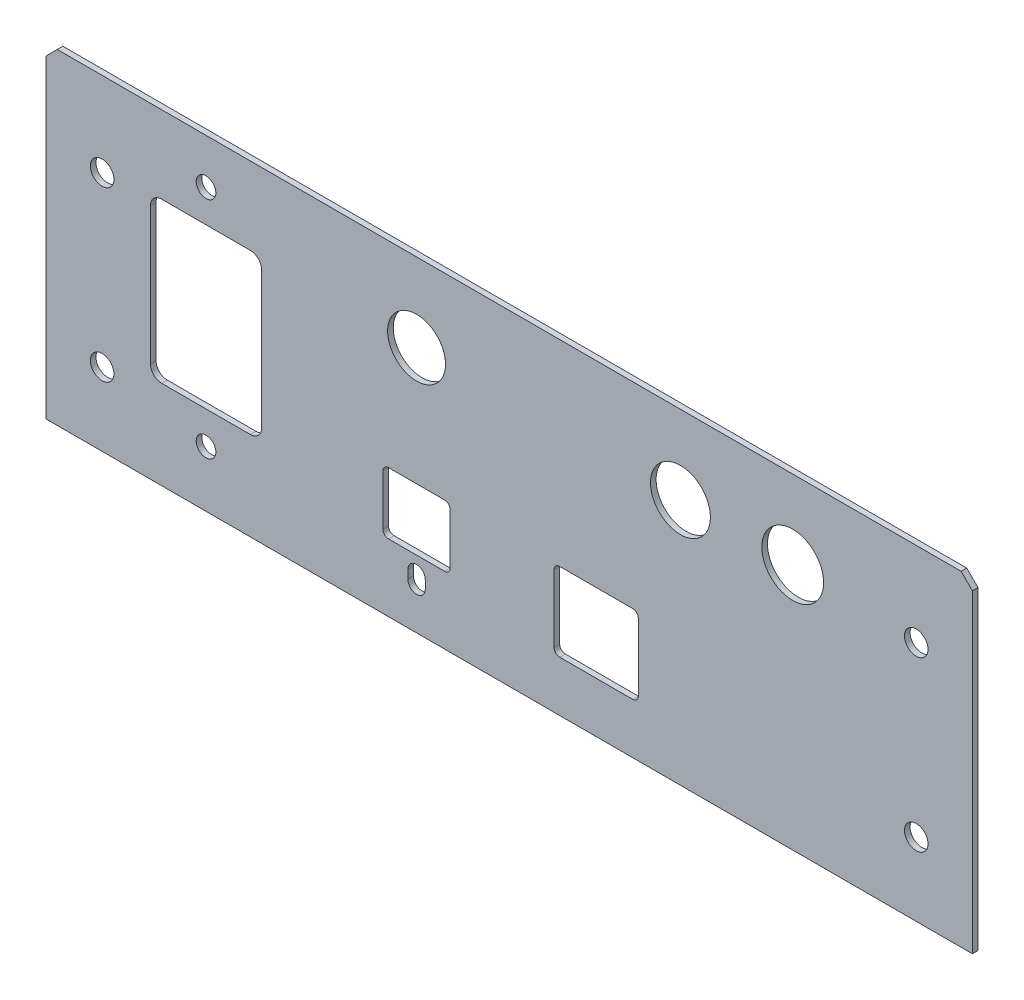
ISO-10303-21;
HEADER;
FILE_DESCRIPTION(('STEP AP214'),'2;1');
FILE_NAME('part.step','',(''),(''),'','','');
FILE_SCHEMA(('AUTOMOTIVE_DESIGN { 1 0 10303 214 1 1 1 1 }'));
ENDSEC;
DATA;
#1=APPLICATION_CONTEXT('core data for automotive mechanical design processes');
#2=APPLICATION_PROTOCOL_DEFINITION('international standard','automotive_design',2000,#1);
#3=PRODUCT_CONTEXT('',#1,'mechanical');
#4=PRODUCT('Part','Part','',(#3));
#5=PRODUCT_RELATED_PRODUCT_CATEGORY('part','',(#4));
#6=PRODUCT_DEFINITION_FORMATION('','',#4);
#7=PRODUCT_DEFINITION_CONTEXT('part definition',#1,'design');
#8=PRODUCT_DEFINITION('design','',#6,#7);
#9=PRODUCT_DEFINITION_SHAPE('','',#8);
#10=(LENGTH_UNIT() NAMED_UNIT(*) SI_UNIT(.MILLI.,.METRE.));
#11=(NAMED_UNIT(*) PLANE_ANGLE_UNIT() SI_UNIT($,.RADIAN.));
#12=(NAMED_UNIT(*) SI_UNIT($,.STERADIAN.) SOLID_ANGLE_UNIT());
#13=UNCERTAINTY_MEASURE_WITH_UNIT(LENGTH_MEASURE(1.E-05),#10,'distance_accuracy_value','');
#14=(GEOMETRIC_REPRESENTATION_CONTEXT(3) GLOBAL_UNCERTAINTY_ASSIGNED_CONTEXT((#13)) GLOBAL_UNIT_ASSIGNED_CONTEXT((#10,
#11,#12)) REPRESENTATION_CONTEXT('',''));
#15=CARTESIAN_POINT('',(0.,0.,0.));
#16=DIRECTION('',(0.,0.,1.));
#17=DIRECTION('',(1.,0.,0.));
#18=AXIS2_PLACEMENT_3D('',#15,#16,#17);
#19=CARTESIAN_POINT('',(82.5,27.,-1.));
#20=DIRECTION('',(1.,0.,0.));
#21=DIRECTION('',(0.,1.,0.));
#22=AXIS2_PLACEMENT_3D('',#19,#20,#21);
#23=PLANE('',#22);
#24=DIRECTION('',(0.,1.,0.));
#25=VECTOR('',#24,1.);
#26=CARTESIAN_POINT('',(82.5,27.,0.));
#27=LINE('',#26,#25);
#28=CARTESIAN_POINT('',(82.5,-29.,0.));
#29=VERTEX_POINT('',#28);
#30=CARTESIAN_POINT('',(82.5,27.,0.));
#31=VERTEX_POINT('',#30);
#32=EDGE_CURVE('E532',#29,#31,#27,.T.);
#33=ORIENTED_EDGE('',*,*,#32,.F.);
#34=DIRECTION('',(0.,0.,1.));
#35=VECTOR('',#34,1.);
#36=CARTESIAN_POINT('',(82.5,-29.,-1.));
#37=LINE('',#36,#35);
#38=CARTESIAN_POINT('',(82.5,-29.,-1.));
#39=VERTEX_POINT('',#38);
#40=EDGE_CURVE('E11',#39,#29,#37,.T.);
#41=ORIENTED_EDGE('',*,*,#40,.F.);
#42=DIRECTION('',(0.,1.,0.));
#43=VECTOR('',#42,1.);
#44=CARTESIAN_POINT('',(82.5,27.,-1.));
#45=LINE('',#44,#43);
#46=CARTESIAN_POINT('',(82.5,27.,-1.));
#47=VERTEX_POINT('',#46);
#48=EDGE_CURVE('E533',#39,#47,#45,.T.);
#49=ORIENTED_EDGE('',*,*,#48,.T.);
#50=DIRECTION('',(0.,0.,1.));
#51=VECTOR('',#50,1.);
#52=CARTESIAN_POINT('',(82.5,27.,-1.));
#53=LINE('',#52,#51);
#54=EDGE_CURVE('E42',#47,#31,#53,.T.);
#55=ORIENTED_EDGE('',*,*,#54,.T.);
#56=EDGE_LOOP('',(#33,#41,#49,#55));
#57=FACE_BOUND('',#56,.T.);
#58=ADVANCED_FACE('F39',(#57),#23,.T.);
#59=CARTESIAN_POINT('',(-82.5,-29.,-1.));
#60=DIRECTION('',(0.,-1.,0.));
#61=DIRECTION('',(0.,0.,-1.));
#62=AXIS2_PLACEMENT_3D('',#59,#60,#61);
#63=PLANE('',#62);
#64=DIRECTION('',(1.,0.,0.));
#65=VECTOR('',#64,1.);
#66=CARTESIAN_POINT('',(-82.5,-29.,0.));
#67=LINE('',#66,#65);
#68=CARTESIAN_POINT('',(-82.5,-29.,0.));
#69=VERTEX_POINT('',#68);
#70=EDGE_CURVE('E537',#69,#29,#67,.T.);
#71=ORIENTED_EDGE('',*,*,#70,.F.);
#72=DIRECTION('',(0.,0.,1.));
#73=VECTOR('',#72,1.);
#74=CARTESIAN_POINT('',(-82.5,-29.,-1.));
#75=LINE('',#74,#73);
#76=CARTESIAN_POINT('',(-82.5,-29.,-1.));
#77=VERTEX_POINT('',#76);
#78=EDGE_CURVE('E47',#77,#69,#75,.T.);
#79=ORIENTED_EDGE('',*,*,#78,.F.);
#80=DIRECTION('',(1.,0.,0.));
#81=VECTOR('',#80,1.);
#82=CARTESIAN_POINT('',(-82.5,-29.,-1.));
#83=LINE('',#82,#81);
#84=EDGE_CURVE('E549',#77,#39,#83,.T.);
#85=ORIENTED_EDGE('',*,*,#84,.T.);
#86=ORIENTED_EDGE('',*,*,#40,.T.);
#87=EDGE_LOOP('',(#71,#79,#85,#86));
#88=FACE_BOUND('',#87,.T.);
#89=ADVANCED_FACE('F586',(#88),#63,.T.);
#90=CARTESIAN_POINT('',(-82.5,27.,-1.));
#91=DIRECTION('',(-1.,0.,0.));
#92=DIRECTION('',(0.,0.,1.));
#93=AXIS2_PLACEMENT_3D('',#90,#91,#92);
#94=PLANE('',#93);
#95=DIRECTION('',(0.,-1.,0.));
#96=VECTOR('',#95,1.);
#97=CARTESIAN_POINT('',(-82.5,27.,0.));
#98=LINE('',#97,#96);
#99=CARTESIAN_POINT('',(-82.5,27.,0.));
#100=VERTEX_POINT('',#99);
#101=EDGE_CURVE('E563',#100,#69,#98,.T.);
#102=ORIENTED_EDGE('',*,*,#101,.F.);
#103=DIRECTION('',(0.,0.,1.));
#104=VECTOR('',#103,1.);
#105=CARTESIAN_POINT('',(-82.5,27.,-1.));
#106=LINE('',#105,#104);
#107=CARTESIAN_POINT('',(-82.5,27.,-1.));
#108=VERTEX_POINT('',#107);
#109=EDGE_CURVE('E569',#108,#100,#106,.T.);
#110=ORIENTED_EDGE('',*,*,#109,.F.);
#111=DIRECTION('',(0.,-1.,0.));
#112=VECTOR('',#111,1.);
#113=CARTESIAN_POINT('',(-82.5,27.,-1.));
#114=LINE('',#113,#112);
#115=EDGE_CURVE('E546',#108,#77,#114,.T.);
#116=ORIENTED_EDGE('',*,*,#115,.T.);
#117=ORIENTED_EDGE('',*,*,#78,.T.);
#118=EDGE_LOOP('',(#102,#110,#116,#117));
#119=FACE_BOUND('',#118,.T.);
#120=ADVANCED_FACE('F598',(#119),#94,.T.);
#121=CARTESIAN_POINT('',(-80.5,29.,-1.));
#122=DIRECTION('',(-0.707106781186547,0.707106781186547,0.));
#123=DIRECTION('',(-0.707106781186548,-0.707106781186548,0.));
#124=AXIS2_PLACEMENT_3D('',#121,#122,#123);
#125=PLANE('',#124);
#126=DIRECTION('',(-0.707106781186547,-0.707106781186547,0.));
#127=VECTOR('',#126,1.);
#128=CARTESIAN_POINT('',(-80.5,29.,0.));
#129=LINE('',#128,#127);
#130=CARTESIAN_POINT('',(-80.5,29.,0.));
#131=VERTEX_POINT('',#130);
#132=EDGE_CURVE('E560',#131,#100,#129,.T.);
#133=ORIENTED_EDGE('',*,*,#132,.F.);
#134=DIRECTION('',(0.,0.,1.));
#135=VECTOR('',#134,1.);
#136=CARTESIAN_POINT('',(-80.5,29.,-1.));
#137=LINE('',#136,#135);
#138=CARTESIAN_POINT('',(-80.5,29.,-1.));
#139=VERTEX_POINT('',#138);
#140=EDGE_CURVE('E571',#139,#131,#137,.T.);
#141=ORIENTED_EDGE('',*,*,#140,.F.);
#142=DIRECTION('',(-0.707106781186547,-0.707106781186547,0.));
#143=VECTOR('',#142,1.);
#144=CARTESIAN_POINT('',(-80.5,29.,-1.));
#145=LINE('',#144,#143);
#146=EDGE_CURVE('E543',#139,#108,#145,.T.);
#147=ORIENTED_EDGE('',*,*,#146,.T.);
#148=ORIENTED_EDGE('',*,*,#109,.T.);
#149=EDGE_LOOP('',(#133,#141,#147,#148));
#150=FACE_BOUND('',#149,.T.);
#151=ADVANCED_FACE('F596',(#150),#125,.T.);
#152=CARTESIAN_POINT('',(-80.5,29.,-1.));
#153=DIRECTION('',(0.,1.,0.));
#154=DIRECTION('',(0.,0.,1.));
#155=AXIS2_PLACEMENT_3D('',#152,#153,#154);
#156=PLANE('',#155);
#157=DIRECTION('',(-1.,0.,0.));
#158=VECTOR('',#157,1.);
#159=CARTESIAN_POINT('',(-80.5,29.,0.));
#160=LINE('',#159,#158);
#161=CARTESIAN_POINT('',(80.5,29.,0.));
#162=VERTEX_POINT('',#161);
#163=EDGE_CURVE('E557',#162,#131,#160,.T.);
#164=ORIENTED_EDGE('',*,*,#163,.F.);
#165=DIRECTION('',(0.,0.,1.));
#166=VECTOR('',#165,1.);
#167=CARTESIAN_POINT('',(80.5,29.,-1.));
#168=LINE('',#167,#166);
#169=CARTESIAN_POINT('',(80.5,29.,-1.));
#170=VERTEX_POINT('',#169);
#171=EDGE_CURVE('E572',#170,#162,#168,.T.);
#172=ORIENTED_EDGE('',*,*,#171,.F.);
#173=DIRECTION('',(-1.,0.,0.));
#174=VECTOR('',#173,1.);
#175=CARTESIAN_POINT('',(-80.5,29.,-1.));
#176=LINE('',#175,#174);
#177=EDGE_CURVE('E540',#170,#139,#176,.T.);
#178=ORIENTED_EDGE('',*,*,#177,.T.);
#179=ORIENTED_EDGE('',*,*,#140,.T.);
#180=EDGE_LOOP('',(#164,#172,#178,#179));
#181=FACE_BOUND('',#180,.T.);
#182=ADVANCED_FACE('F593',(#181),#156,.T.);
#183=CARTESIAN_POINT('',(80.5,29.,-1.));
#184=DIRECTION('',(0.707106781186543,0.707106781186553,0.));
#185=DIRECTION('',(-0.707106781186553,0.707106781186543,0.));
#186=AXIS2_PLACEMENT_3D('',#183,#184,#185);
#187=PLANE('',#186);
#188=DIRECTION('',(-0.707106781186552,0.707106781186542,0.));
#189=VECTOR('',#188,1.);
#190=CARTESIAN_POINT('',(80.5,29.,0.));
#191=LINE('',#190,#189);
#192=EDGE_CURVE('E554',#31,#162,#191,.T.);
#193=ORIENTED_EDGE('',*,*,#192,.F.);
#194=ORIENTED_EDGE('',*,*,#54,.F.);
#195=DIRECTION('',(-0.707106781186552,0.707106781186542,0.));
#196=VECTOR('',#195,1.);
#197=CARTESIAN_POINT('',(80.5,29.,-1.));
#198=LINE('',#197,#196);
#199=EDGE_CURVE('E536',#47,#170,#198,.T.);
#200=ORIENTED_EDGE('',*,*,#199,.T.);
#201=ORIENTED_EDGE('',*,*,#171,.T.);
#202=EDGE_LOOP('',(#193,#194,#200,#201));
#203=FACE_BOUND('',#202,.T.);
#204=ADVANCED_FACE('F580',(#203),#187,.T.);
#205=CARTESIAN_POINT('',(0.,0.,-1.));
#206=DIRECTION('',(0.,0.,1.));
#207=DIRECTION('',(1.,0.,0.));
#208=AXIS2_PLACEMENT_3D('',#205,#206,#207);
#209=PLANE('',#208);
#210=CARTESIAN_POINT('',(72.5,14.,-1.));
#211=DIRECTION('',(0.,0.,1.));
#212=DIRECTION('',(1.,0.,0.));
#213=AXIS2_PLACEMENT_3D('',#210,#211,#212);
#214=CIRCLE('',#213,2.1);
#215=CARTESIAN_POINT('',(74.6,14.,-1.));
#216=VERTEX_POINT('',#215);
#217=EDGE_CURVE('E325',#216,#216,#214,.F.);
#218=ORIENTED_EDGE('',*,*,#217,.F.);
#219=EDGE_LOOP('',(#218));
#220=FACE_BOUND('',#219,.T.);
#221=DIRECTION('',(0.,1.,0.));
#222=VECTOR('',#221,1.);
#223=CARTESIAN_POINT('',(8.00000000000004,-6.99999999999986,-1.));
#224=LINE('',#223,#222);
#225=CARTESIAN_POINT('',(8.00000000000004,-18.9999999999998,-1.));
#226=VERTEX_POINT('',#225);
#227=CARTESIAN_POINT('',(8.00000000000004,-6.99999999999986,-1.));
#228=VERTEX_POINT('',#227);
#229=EDGE_CURVE('E337',#226,#228,#224,.T.);
#230=ORIENTED_EDGE('',*,*,#229,.F.);
#231=CARTESIAN_POINT('',(9.00000000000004,-18.9999999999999,-1.));
#232=DIRECTION('',(0.,0.,1.));
#233=DIRECTION('',(1.,0.,0.));
#234=AXIS2_PLACEMENT_3D('',#231,#232,#233);
#235=CIRCLE('',#234,1.);
#236=CARTESIAN_POINT('',(9.00000000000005,-19.9999999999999,-1.));
#237=VERTEX_POINT('',#236);
#238=EDGE_CURVE('E340',#237,#226,#235,.F.);
#239=ORIENTED_EDGE('',*,*,#238,.F.);
#240=DIRECTION('',(-1.,0.,0.));
#241=VECTOR('',#240,1.);
#242=CARTESIAN_POINT('',(9.00000000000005,-19.9999999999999,-1.));
#243=LINE('',#242,#241);
#244=CARTESIAN_POINT('',(22.,-19.9999999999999,-1.));
#245=VERTEX_POINT('',#244);
#246=EDGE_CURVE('E369',#245,#237,#243,.T.);
#247=ORIENTED_EDGE('',*,*,#246,.F.);
#248=CARTESIAN_POINT('',(22.,-18.9999999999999,-1.));
#249=DIRECTION('',(0.,0.,1.));
#250=DIRECTION('',(1.,0.,0.));
#251=AXIS2_PLACEMENT_3D('',#248,#249,#250);
#252=CIRCLE('',#251,1.);
#253=CARTESIAN_POINT('',(23.,-18.9999999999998,-1.));
#254=VERTEX_POINT('',#253);
#255=EDGE_CURVE('E55',#254,#245,#252,.F.);
#256=ORIENTED_EDGE('',*,*,#255,.F.);
#257=DIRECTION('',(0.,-1.,0.));
#258=VECTOR('',#257,1.);
#259=CARTESIAN_POINT('',(23.,-6.99999999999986,-1.));
#260=LINE('',#259,#258);
#261=CARTESIAN_POINT('',(23.,-6.99999999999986,-1.));
#262=VERTEX_POINT('',#261);
#263=EDGE_CURVE('E324',#262,#254,#260,.T.);
#264=ORIENTED_EDGE('',*,*,#263,.F.);
#265=CARTESIAN_POINT('',(22.,-6.99999999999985,-1.));
#266=DIRECTION('',(0.,0.,1.));
#267=DIRECTION('',(1.,0.,0.));
#268=AXIS2_PLACEMENT_3D('',#265,#266,#267);
#269=CIRCLE('',#268,1.);
#270=CARTESIAN_POINT('',(22.,-5.99999999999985,-1.));
#271=VERTEX_POINT('',#270);
#272=EDGE_CURVE('E328',#271,#262,#269,.F.);
#273=ORIENTED_EDGE('',*,*,#272,.F.);
#274=DIRECTION('',(1.,0.,0.));
#275=VECTOR('',#274,1.);
#276=CARTESIAN_POINT('',(9.00000000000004,-5.99999999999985,-1.));
#277=LINE('',#276,#275);
#278=CARTESIAN_POINT('',(9.00000000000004,-5.99999999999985,-1.));
#279=VERTEX_POINT('',#278);
#280=EDGE_CURVE('E331',#279,#271,#277,.T.);
#281=ORIENTED_EDGE('',*,*,#280,.F.);
#282=CARTESIAN_POINT('',(9.00000000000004,-6.99999999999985,-1.));
#283=DIRECTION('',(0.,0.,1.));
#284=DIRECTION('',(1.,0.,0.));
#285=AXIS2_PLACEMENT_3D('',#282,#283,#284);
#286=CIRCLE('',#285,1.);
#287=EDGE_CURVE('E334',#228,#279,#286,.F.);
#288=ORIENTED_EDGE('',*,*,#287,.F.);
#289=EDGE_LOOP('',(#230,#239,#247,#256,#264,#273,#281,#288));
#290=FACE_BOUND('',#289,.T.);
#291=DIRECTION('',(1.,0.,0.));
#292=VECTOR('',#291,1.);
#293=CARTESIAN_POINT('',(-21.5,-6.00000000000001,-1.));
#294=LINE('',#293,#292);
#295=CARTESIAN_POINT('',(-21.5,-6.00000000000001,-1.));
#296=VERTEX_POINT('',#295);
#297=CARTESIAN_POINT('',(-11.5,-6.00000000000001,-1.));
#298=VERTEX_POINT('',#297);
#299=EDGE_CURVE('E285',#296,#298,#294,.T.);
#300=ORIENTED_EDGE('',*,*,#299,.F.);
#301=CARTESIAN_POINT('',(-21.5,-7.00000000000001,-1.));
#302=DIRECTION('',(0.,0.,1.));
#303=DIRECTION('',(1.,0.,0.));
#304=AXIS2_PLACEMENT_3D('',#301,#302,#303);
#305=CIRCLE('',#304,1.);
#306=CARTESIAN_POINT('',(-22.5,-7.00000000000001,-1.));
#307=VERTEX_POINT('',#306);
#308=EDGE_CURVE('E264',#307,#296,#305,.F.);
#309=ORIENTED_EDGE('',*,*,#308,.F.);
#310=DIRECTION('',(0.,1.,0.));
#311=VECTOR('',#310,1.);
#312=CARTESIAN_POINT('',(-22.5,-7.00000000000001,-1.));
#313=LINE('',#312,#311);
#314=CARTESIAN_POINT('',(-22.5,-16.,-1.));
#315=VERTEX_POINT('',#314);
#316=EDGE_CURVE('E275',#315,#307,#313,.T.);
#317=ORIENTED_EDGE('',*,*,#316,.F.);
#318=CARTESIAN_POINT('',(-21.5,-16.,-1.));
#319=DIRECTION('',(0.,0.,1.));
#320=DIRECTION('',(1.,0.,0.));
#321=AXIS2_PLACEMENT_3D('',#318,#319,#320);
#322=CIRCLE('',#321,1.);
#323=CARTESIAN_POINT('',(-21.5,-17.,-1.));
#324=VERTEX_POINT('',#323);
#325=EDGE_CURVE('E63',#324,#315,#322,.F.);
#326=ORIENTED_EDGE('',*,*,#325,.F.);
#327=DIRECTION('',(-1.,0.,0.));
#328=VECTOR('',#327,1.);
#329=CARTESIAN_POINT('',(-21.5,-17.,-1.));
#330=LINE('',#329,#328);
#331=CARTESIAN_POINT('',(-11.5,-17.,-1.));
#332=VERTEX_POINT('',#331);
#333=EDGE_CURVE('E1214',#332,#324,#330,.T.);
#334=ORIENTED_EDGE('',*,*,#333,.F.);
#335=CARTESIAN_POINT('',(-11.5,-16.,-1.));
#336=DIRECTION('',(0.,0.,1.));
#337=DIRECTION('',(1.,0.,0.));
#338=AXIS2_PLACEMENT_3D('',#335,#336,#337);
#339=CIRCLE('',#338,1.);
#340=CARTESIAN_POINT('',(-10.5,-16.,-1.));
#341=VERTEX_POINT('',#340);
#342=EDGE_CURVE('E1217',#341,#332,#339,.F.);
#343=ORIENTED_EDGE('',*,*,#342,.F.);
#344=DIRECTION('',(0.,-1.,0.));
#345=VECTOR('',#344,1.);
#346=CARTESIAN_POINT('',(-10.5,-7.00000000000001,-1.));
#347=LINE('',#346,#345);
#348=CARTESIAN_POINT('',(-10.5,-7.00000000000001,-1.));
#349=VERTEX_POINT('',#348);
#350=EDGE_CURVE('E1222',#349,#341,#347,.T.);
#351=ORIENTED_EDGE('',*,*,#350,.F.);
#352=CARTESIAN_POINT('',(-11.5,-7.00000000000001,-1.));
#353=DIRECTION('',(0.,0.,1.));
#354=DIRECTION('',(1.,0.,0.));
#355=AXIS2_PLACEMENT_3D('',#352,#353,#354);
#356=CIRCLE('',#355,1.);
#357=EDGE_CURVE('E289',#298,#349,#356,.F.);
#358=ORIENTED_EDGE('',*,*,#357,.F.);
#359=EDGE_LOOP('',(#300,#309,#317,#326,#334,#343,#351,#358));
#360=FACE_BOUND('',#359,.T.);
#361=CARTESIAN_POINT('',(-72.5,-16.,-1.));
#362=DIRECTION('',(0.,0.,1.));
#363=DIRECTION('',(1.,0.,0.));
#364=AXIS2_PLACEMENT_3D('',#361,#362,#363);
#365=CIRCLE('',#364,2.1);
#366=CARTESIAN_POINT('',(-70.4,-16.,-1.));
#367=VERTEX_POINT('',#366);
#368=EDGE_CURVE('E402',#367,#367,#365,.F.);
#369=ORIENTED_EDGE('',*,*,#368,.F.);
#370=EDGE_LOOP('',(#369));
#371=FACE_BOUND('',#370,.T.);
#372=CARTESIAN_POINT('',(72.5,-16.,-1.));
#373=DIRECTION('',(0.,0.,1.));
#374=DIRECTION('',(1.,0.,0.));
#375=AXIS2_PLACEMENT_3D('',#372,#373,#374);
#376=CIRCLE('',#375,2.1);
#377=CARTESIAN_POINT('',(74.6,-16.,-1.));
#378=VERTEX_POINT('',#377);
#379=EDGE_CURVE('E395',#378,#378,#376,.F.);
#380=ORIENTED_EDGE('',*,*,#379,.F.);
#381=EDGE_LOOP('',(#380));
#382=FACE_BOUND('',#381,.T.);
#383=CARTESIAN_POINT('',(-72.5,14.,-1.));
#384=DIRECTION('',(0.,0.,1.));
#385=DIRECTION('',(1.,0.,0.));
#386=AXIS2_PLACEMENT_3D('',#383,#384,#385);
#387=CIRCLE('',#386,2.1);
#388=CARTESIAN_POINT('',(-70.4,14.,-1.));
#389=VERTEX_POINT('',#388);
#390=EDGE_CURVE('E394',#389,#389,#387,.F.);
#391=ORIENTED_EDGE('',*,*,#390,.F.);
#392=EDGE_LOOP('',(#391));
#393=FACE_BOUND('',#392,.T.);
#394=DIRECTION('',(0.,1.,0.));
#395=VECTOR('',#394,1.);
#396=CARTESIAN_POINT('',(-18.05,-21.5,-1.));
#397=LINE('',#396,#395);
#398=CARTESIAN_POINT('',(-18.05,-21.5,-1.));
#399=VERTEX_POINT('',#398);
#400=CARTESIAN_POINT('',(-18.05,-20.,-1.));
#401=VERTEX_POINT('',#400);
#402=EDGE_CURVE('E410',#399,#401,#397,.T.);
#403=ORIENTED_EDGE('',*,*,#402,.F.);
#404=CARTESIAN_POINT('',(-16.5,-21.5,-1.));
#405=DIRECTION('',(0.,0.,1.));
#406=DIRECTION('',(1.,0.,0.));
#407=AXIS2_PLACEMENT_3D('',#404,#405,#406);
#408=CIRCLE('',#407,1.55);
#409=CARTESIAN_POINT('',(-14.95,-21.5,-1.));
#410=VERTEX_POINT('',#409);
#411=EDGE_CURVE('E413',#410,#399,#408,.F.);
#412=ORIENTED_EDGE('',*,*,#411,.F.);
#413=DIRECTION('',(0.,-1.,0.));
#414=VECTOR('',#413,1.);
#415=CARTESIAN_POINT('',(-14.95,-21.5,-1.));
#416=LINE('',#415,#414);
#417=CARTESIAN_POINT('',(-14.95,-20.,-1.));
#418=VERTEX_POINT('',#417);
#419=EDGE_CURVE('E430',#418,#410,#416,.T.);
#420=ORIENTED_EDGE('',*,*,#419,.F.);
#421=CARTESIAN_POINT('',(-16.5,-20.,-1.));
#422=DIRECTION('',(0.,0.,1.));
#423=DIRECTION('',(1.,0.,0.));
#424=AXIS2_PLACEMENT_3D('',#421,#422,#423);
#425=CIRCLE('',#424,1.55);
#426=EDGE_CURVE('E398',#401,#418,#425,.F.);
#427=ORIENTED_EDGE('',*,*,#426,.F.);
#428=EDGE_LOOP('',(#403,#412,#420,#427));
#429=FACE_BOUND('',#428,.T.);
#430=CARTESIAN_POINT('',(30.5,15.,-1.));
#431=DIRECTION('',(0.,0.,1.));
#432=DIRECTION('',(1.,0.,0.));
#433=AXIS2_PLACEMENT_3D('',#430,#431,#432);
#434=CIRCLE('',#433,5.33502606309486);
#435=CARTESIAN_POINT('',(35.8350260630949,15.,-1.));
#436=VERTEX_POINT('',#435);
#437=EDGE_CURVE('E443',#436,#436,#434,.F.);
#438=ORIENTED_EDGE('',*,*,#437,.F.);
#439=EDGE_LOOP('',(#438));
#440=FACE_BOUND('',#439,.T.);
#441=CARTESIAN_POINT('',(-16.5,15.,-1.));
#442=DIRECTION('',(0.,0.,1.));
#443=DIRECTION('',(1.,0.,0.));
#444=AXIS2_PLACEMENT_3D('',#441,#442,#443);
#445=CIRCLE('',#444,5.15465225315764);
#446=CARTESIAN_POINT('',(-11.3453477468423,15.,-1.));
#447=VERTEX_POINT('',#446);
#448=EDGE_CURVE('E444',#447,#447,#445,.F.);
#449=ORIENTED_EDGE('',*,*,#448,.F.);
#450=EDGE_LOOP('',(#449));
#451=FACE_BOUND('',#450,.T.);
#452=CARTESIAN_POINT('',(50.5,15.,-1.));
#453=DIRECTION('',(0.,0.,1.));
#454=DIRECTION('',(1.,0.,0.));
#455=AXIS2_PLACEMENT_3D('',#452,#453,#454);
#456=CIRCLE('',#455,5.5);
#457=CARTESIAN_POINT('',(56.,15.,-1.));
#458=VERTEX_POINT('',#457);
#459=EDGE_CURVE('E454',#458,#458,#456,.F.);
#460=ORIENTED_EDGE('',*,*,#459,.F.);
#461=EDGE_LOOP('',(#460));
#462=FACE_BOUND('',#461,.T.);
#463=CARTESIAN_POINT('',(-54.,21.,-1.));
#464=DIRECTION('',(0.,0.,1.));
#465=DIRECTION('',(1.,0.,0.));
#466=AXIS2_PLACEMENT_3D('',#463,#464,#465);
#467=CIRCLE('',#466,1.75);
#468=CARTESIAN_POINT('',(-52.25,21.,-1.));
#469=VERTEX_POINT('',#468);
#470=EDGE_CURVE('E461',#469,#469,#467,.F.);
#471=ORIENTED_EDGE('',*,*,#470,.F.);
#472=EDGE_LOOP('',(#471));
#473=FACE_BOUND('',#472,.T.);
#474=CARTESIAN_POINT('',(-53.9999999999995,-19.,-1.));
#475=DIRECTION('',(0.,0.,1.));
#476=DIRECTION('',(1.,0.,0.));
#477=AXIS2_PLACEMENT_3D('',#474,#475,#476);
#478=CIRCLE('',#477,1.75);
#479=CARTESIAN_POINT('',(-52.2499999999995,-19.,-1.));
#480=VERTEX_POINT('',#479);
#481=EDGE_CURVE('E462',#480,#480,#478,.F.);
#482=ORIENTED_EDGE('',*,*,#481,.F.);
#483=EDGE_LOOP('',(#482));
#484=FACE_BOUND('',#483,.T.);
#485=DIRECTION('',(1.,0.,0.));
#486=VECTOR('',#485,1.);
#487=CARTESIAN_POINT('',(-61.9,15.2,-1.));
#488=LINE('',#487,#486);
#489=CARTESIAN_POINT('',(-61.9,15.2,-1.));
#490=VERTEX_POINT('',#489);
#491=CARTESIAN_POINT('',(-46.1,15.2,-1.));
#492=VERTEX_POINT('',#491);
#493=EDGE_CURVE('E483',#490,#492,#488,.T.);
#494=ORIENTED_EDGE('',*,*,#493,.F.);
#495=CARTESIAN_POINT('',(-61.9,13.2,-1.));
#496=DIRECTION('',(0.,0.,1.));
#497=DIRECTION('',(1.,0.,0.));
#498=AXIS2_PLACEMENT_3D('',#495,#496,#497);
#499=CIRCLE('',#498,2.);
#500=CARTESIAN_POINT('',(-63.9,13.2,-1.));
#501=VERTEX_POINT('',#500);
#502=EDGE_CURVE('E486',#501,#490,#499,.F.);
#503=ORIENTED_EDGE('',*,*,#502,.F.);
#504=DIRECTION('',(0.,1.,0.));
#505=VECTOR('',#504,1.);
#506=CARTESIAN_POINT('',(-63.9,13.2,-1.));
#507=LINE('',#506,#505);
#508=CARTESIAN_POINT('',(-63.9,-11.2,-1.));
#509=VERTEX_POINT('',#508);
#510=EDGE_CURVE('E515',#509,#501,#507,.T.);
#511=ORIENTED_EDGE('',*,*,#510,.F.);
#512=CARTESIAN_POINT('',(-61.9,-11.2,-1.));
#513=DIRECTION('',(0.,0.,1.));
#514=DIRECTION('',(1.,0.,0.));
#515=AXIS2_PLACEMENT_3D('',#512,#513,#514);
#516=CIRCLE('',#515,2.);
#517=CARTESIAN_POINT('',(-61.9,-13.2,-1.));
#518=VERTEX_POINT('',#517);
#519=EDGE_CURVE('E465',#518,#509,#516,.F.);
#520=ORIENTED_EDGE('',*,*,#519,.F.);
#521=DIRECTION('',(-1.,0.,0.));
#522=VECTOR('',#521,1.);
#523=CARTESIAN_POINT('',(-61.9,-13.2,-1.));
#524=LINE('',#523,#522);
#525=CARTESIAN_POINT('',(-46.1,-13.2,-1.));
#526=VERTEX_POINT('',#525);
#527=EDGE_CURVE('E471',#526,#518,#524,.T.);
#528=ORIENTED_EDGE('',*,*,#527,.F.);
#529=CARTESIAN_POINT('',(-46.1,-11.2,-1.));
#530=DIRECTION('',(0.,0.,1.));
#531=DIRECTION('',(1.,0.,0.));
#532=AXIS2_PLACEMENT_3D('',#529,#530,#531);
#533=CIRCLE('',#532,2.);
#534=CARTESIAN_POINT('',(-44.1,-11.2,-1.));
#535=VERTEX_POINT('',#534);
#536=EDGE_CURVE('E474',#535,#526,#533,.F.);
#537=ORIENTED_EDGE('',*,*,#536,.F.);
#538=DIRECTION('',(0.,-1.,0.));
#539=VECTOR('',#538,1.);
#540=CARTESIAN_POINT('',(-44.1,13.2,-1.));
#541=LINE('',#540,#539);
#542=CARTESIAN_POINT('',(-44.1,13.2,-1.));
#543=VERTEX_POINT('',#542);
#544=EDGE_CURVE('E477',#543,#535,#541,.T.);
#545=ORIENTED_EDGE('',*,*,#544,.F.);
#546=CARTESIAN_POINT('',(-46.1,13.2,-1.));
#547=DIRECTION('',(0.,0.,1.));
#548=DIRECTION('',(1.,0.,0.));
#549=AXIS2_PLACEMENT_3D('',#546,#547,#548);
#550=CIRCLE('',#549,2.);
#551=EDGE_CURVE('E480',#492,#543,#550,.F.);
#552=ORIENTED_EDGE('',*,*,#551,.F.);
#553=EDGE_LOOP('',(#494,#503,#511,#520,#528,#537,#545,#552));
#554=FACE_BOUND('',#553,.T.);
#555=ORIENTED_EDGE('',*,*,#48,.F.);
#556=ORIENTED_EDGE('',*,*,#84,.F.);
#557=ORIENTED_EDGE('',*,*,#115,.F.);
#558=ORIENTED_EDGE('',*,*,#146,.F.);
#559=ORIENTED_EDGE('',*,*,#177,.F.);
#560=ORIENTED_EDGE('',*,*,#199,.F.);
#561=EDGE_LOOP('',(#555,#556,#557,#558,#559,#560));
#562=FACE_BOUND('',#561,.T.);
#563=ADVANCED_FACE('F281',(#220,#290,#360,#371,#382,#393,#429,#440,#451,#462,#473,#484,#554,
#562),#209,.F.);
#564=CARTESIAN_POINT('',(0.,0.,0.));
#565=DIRECTION('',(0.,0.,1.));
#566=DIRECTION('',(1.,0.,0.));
#567=AXIS2_PLACEMENT_3D('',#564,#565,#566);
#568=PLANE('',#567);
#569=CARTESIAN_POINT('',(72.5,14.,0.));
#570=DIRECTION('',(0.,0.,1.));
#571=DIRECTION('',(1.,0.,0.));
#572=AXIS2_PLACEMENT_3D('',#569,#570,#571);
#573=CIRCLE('',#572,2.1);
#574=CARTESIAN_POINT('',(74.6,14.,0.));
#575=VERTEX_POINT('',#574);
#576=EDGE_CURVE('E386',#575,#575,#573,.T.);
#577=ORIENTED_EDGE('',*,*,#576,.F.);
#578=EDGE_LOOP('',(#577));
#579=FACE_BOUND('',#578,.T.);
#580=CARTESIAN_POINT('',(9.00000000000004,-18.9999999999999,0.));
#581=DIRECTION('',(0.,0.,1.));
#582=DIRECTION('',(1.,0.,0.));
#583=AXIS2_PLACEMENT_3D('',#580,#581,#582);
#584=CIRCLE('',#583,1.);
#585=CARTESIAN_POINT('',(8.00000000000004,-18.9999999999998,0.));
#586=VERTEX_POINT('',#585);
#587=CARTESIAN_POINT('',(9.00000000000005,-19.9999999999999,0.));
#588=VERTEX_POINT('',#587);
#589=EDGE_CURVE('E343',#586,#588,#584,.T.);
#590=ORIENTED_EDGE('',*,*,#589,.F.);
#591=DIRECTION('',(0.,-1.,0.));
#592=VECTOR('',#591,1.);
#593=CARTESIAN_POINT('',(8.00000000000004,-6.99999999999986,0.));
#594=LINE('',#593,#592);
#595=CARTESIAN_POINT('',(8.00000000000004,-6.99999999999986,0.));
#596=VERTEX_POINT('',#595);
#597=EDGE_CURVE('E363',#596,#586,#594,.T.);
#598=ORIENTED_EDGE('',*,*,#597,.F.);
#599=CARTESIAN_POINT('',(9.00000000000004,-6.99999999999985,0.));
#600=DIRECTION('',(0.,0.,1.));
#601=DIRECTION('',(1.,0.,0.));
#602=AXIS2_PLACEMENT_3D('',#599,#600,#601);
#603=CIRCLE('',#602,1.);
#604=CARTESIAN_POINT('',(9.00000000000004,-5.99999999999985,0.));
#605=VERTEX_POINT('',#604);
#606=EDGE_CURVE('E360',#605,#596,#603,.T.);
#607=ORIENTED_EDGE('',*,*,#606,.F.);
#608=DIRECTION('',(-1.,0.,0.));
#609=VECTOR('',#608,1.);
#610=CARTESIAN_POINT('',(9.00000000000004,-5.99999999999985,0.));
#611=LINE('',#610,#609);
#612=CARTESIAN_POINT('',(22.,-5.99999999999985,0.));
#613=VERTEX_POINT('',#612);
#614=EDGE_CURVE('E357',#613,#605,#611,.T.);
#615=ORIENTED_EDGE('',*,*,#614,.F.);
#616=CARTESIAN_POINT('',(22.,-6.99999999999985,0.));
#617=DIRECTION('',(0.,0.,1.));
#618=DIRECTION('',(1.,0.,0.));
#619=AXIS2_PLACEMENT_3D('',#616,#617,#618);
#620=CIRCLE('',#619,1.);
#621=CARTESIAN_POINT('',(23.,-6.99999999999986,0.));
#622=VERTEX_POINT('',#621);
#623=EDGE_CURVE('E354',#622,#613,#620,.T.);
#624=ORIENTED_EDGE('',*,*,#623,.F.);
#625=DIRECTION('',(0.,1.,0.));
#626=VECTOR('',#625,1.);
#627=CARTESIAN_POINT('',(23.,-6.99999999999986,0.));
#628=LINE('',#627,#626);
#629=CARTESIAN_POINT('',(23.,-18.9999999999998,0.));
#630=VERTEX_POINT('',#629);
#631=EDGE_CURVE('E351',#630,#622,#628,.T.);
#632=ORIENTED_EDGE('',*,*,#631,.F.);
#633=CARTESIAN_POINT('',(22.,-18.9999999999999,0.));
#634=DIRECTION('',(0.,0.,1.));
#635=DIRECTION('',(1.,0.,0.));
#636=AXIS2_PLACEMENT_3D('',#633,#634,#635);
#637=CIRCLE('',#636,1.);
#638=CARTESIAN_POINT('',(22.,-19.9999999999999,0.));
#639=VERTEX_POINT('',#638);
#640=EDGE_CURVE('E348',#639,#630,#637,.T.);
#641=ORIENTED_EDGE('',*,*,#640,.F.);
#642=DIRECTION('',(1.,0.,0.));
#643=VECTOR('',#642,1.);
#644=CARTESIAN_POINT('',(9.00000000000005,-19.9999999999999,0.));
#645=LINE('',#644,#643);
#646=EDGE_CURVE('E345',#588,#639,#645,.T.);
#647=ORIENTED_EDGE('',*,*,#646,.F.);
#648=EDGE_LOOP('',(#590,#598,#607,#615,#624,#632,#641,#647));
#649=FACE_BOUND('',#648,.T.);
#650=CARTESIAN_POINT('',(-21.5,-7.00000000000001,0.));
#651=DIRECTION('',(0.,0.,1.));
#652=DIRECTION('',(1.,0.,0.));
#653=AXIS2_PLACEMENT_3D('',#650,#651,#652);
#654=CIRCLE('',#653,1.);
#655=CARTESIAN_POINT('',(-21.5,-6.00000000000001,0.));
#656=VERTEX_POINT('',#655);
#657=CARTESIAN_POINT('',(-22.5,-7.00000000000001,0.));
#658=VERTEX_POINT('',#657);
#659=EDGE_CURVE('E267',#656,#658,#654,.T.);
#660=ORIENTED_EDGE('',*,*,#659,.F.);
#661=DIRECTION('',(-1.,0.,0.));
#662=VECTOR('',#661,1.);
#663=CARTESIAN_POINT('',(-21.5,-6.00000000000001,0.));
#664=LINE('',#663,#662);
#665=CARTESIAN_POINT('',(-11.5,-6.00000000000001,0.));
#666=VERTEX_POINT('',#665);
#667=EDGE_CURVE('E272',#666,#656,#664,.T.);
#668=ORIENTED_EDGE('',*,*,#667,.F.);
#669=CARTESIAN_POINT('',(-11.5,-7.00000000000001,0.));
#670=DIRECTION('',(0.,0.,1.));
#671=DIRECTION('',(1.,0.,0.));
#672=AXIS2_PLACEMENT_3D('',#669,#670,#671);
#673=CIRCLE('',#672,1.);
#674=CARTESIAN_POINT('',(-10.5,-7.00000000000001,0.));
#675=VERTEX_POINT('',#674);
#676=EDGE_CURVE('E306',#675,#666,#673,.T.);
#677=ORIENTED_EDGE('',*,*,#676,.F.);
#678=DIRECTION('',(0.,1.,0.));
#679=VECTOR('',#678,1.);
#680=CARTESIAN_POINT('',(-10.5,-7.00000000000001,0.));
#681=LINE('',#680,#679);
#682=CARTESIAN_POINT('',(-10.5,-16.,0.));
#683=VERTEX_POINT('',#682);
#684=EDGE_CURVE('E303',#683,#675,#681,.T.);
#685=ORIENTED_EDGE('',*,*,#684,.F.);
#686=CARTESIAN_POINT('',(-11.5,-16.,0.));
#687=DIRECTION('',(0.,0.,1.));
#688=DIRECTION('',(1.,0.,0.));
#689=AXIS2_PLACEMENT_3D('',#686,#687,#688);
#690=CIRCLE('',#689,1.);
#691=CARTESIAN_POINT('',(-11.5,-17.,0.));
#692=VERTEX_POINT('',#691);
#693=EDGE_CURVE('E300',#692,#683,#690,.T.);
#694=ORIENTED_EDGE('',*,*,#693,.F.);
#695=DIRECTION('',(1.,0.,0.));
#696=VECTOR('',#695,1.);
#697=CARTESIAN_POINT('',(-21.5,-17.,0.));
#698=LINE('',#697,#696);
#699=CARTESIAN_POINT('',(-21.5,-17.,0.));
#700=VERTEX_POINT('',#699);
#701=EDGE_CURVE('E297',#700,#692,#698,.T.);
#702=ORIENTED_EDGE('',*,*,#701,.F.);
#703=CARTESIAN_POINT('',(-21.5,-16.,0.));
#704=DIRECTION('',(0.,0.,1.));
#705=DIRECTION('',(1.,0.,0.));
#706=AXIS2_PLACEMENT_3D('',#703,#704,#705);
#707=CIRCLE('',#706,1.);
#708=CARTESIAN_POINT('',(-22.5,-16.,0.));
#709=VERTEX_POINT('',#708);
#710=EDGE_CURVE('E294',#709,#700,#707,.T.);
#711=ORIENTED_EDGE('',*,*,#710,.F.);
#712=DIRECTION('',(0.,-1.,0.));
#713=VECTOR('',#712,1.);
#714=CARTESIAN_POINT('',(-22.5,-7.00000000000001,0.));
#715=LINE('',#714,#713);
#716=EDGE_CURVE('E287',#658,#709,#715,.T.);
#717=ORIENTED_EDGE('',*,*,#716,.F.);
#718=EDGE_LOOP('',(#660,#668,#677,#685,#694,#702,#711,#717));
#719=FACE_BOUND('',#718,.T.);
#720=CARTESIAN_POINT('',(-72.5,-16.,0.));
#721=DIRECTION('',(0.,0.,1.));
#722=DIRECTION('',(1.,0.,0.));
#723=AXIS2_PLACEMENT_3D('',#720,#721,#722);
#724=CIRCLE('',#723,2.1);
#725=CARTESIAN_POINT('',(-70.4,-16.,0.));
#726=VERTEX_POINT('',#725);
#727=EDGE_CURVE('E278',#726,#726,#724,.T.);
#728=ORIENTED_EDGE('',*,*,#727,.F.);
#729=EDGE_LOOP('',(#728));
#730=FACE_BOUND('',#729,.T.);
#731=CARTESIAN_POINT('',(72.5,-16.,0.));
#732=DIRECTION('',(0.,0.,1.));
#733=DIRECTION('',(1.,0.,0.));
#734=AXIS2_PLACEMENT_3D('',#731,#732,#733);
#735=CIRCLE('',#734,2.1);
#736=CARTESIAN_POINT('',(74.6,-16.,0.));
#737=VERTEX_POINT('',#736);
#738=EDGE_CURVE('E399',#737,#737,#735,.T.);
#739=ORIENTED_EDGE('',*,*,#738,.F.);
#740=EDGE_LOOP('',(#739));
#741=FACE_BOUND('',#740,.T.);
#742=CARTESIAN_POINT('',(-72.5,14.,0.));
#743=DIRECTION('',(0.,0.,1.));
#744=DIRECTION('',(1.,0.,0.));
#745=AXIS2_PLACEMENT_3D('',#742,#743,#744);
#746=CIRCLE('',#745,2.1);
#747=CARTESIAN_POINT('',(-70.4,14.,0.));
#748=VERTEX_POINT('',#747);
#749=EDGE_CURVE('E391',#748,#748,#746,.T.);
#750=ORIENTED_EDGE('',*,*,#749,.F.);
#751=EDGE_LOOP('',(#750));
#752=FACE_BOUND('',#751,.T.);
#753=CARTESIAN_POINT('',(-16.5,-21.5,0.));
#754=DIRECTION('',(0.,0.,1.));
#755=DIRECTION('',(1.,0.,0.));
#756=AXIS2_PLACEMENT_3D('',#753,#754,#755);
#757=CIRCLE('',#756,1.55);
#758=CARTESIAN_POINT('',(-18.05,-21.5,0.));
#759=VERTEX_POINT('',#758);
#760=CARTESIAN_POINT('',(-14.95,-21.5,0.));
#761=VERTEX_POINT('',#760);
#762=EDGE_CURVE('E416',#759,#761,#757,.T.);
#763=ORIENTED_EDGE('',*,*,#762,.F.);
#764=DIRECTION('',(0.,-1.,0.));
#765=VECTOR('',#764,1.);
#766=CARTESIAN_POINT('',(-18.05,-21.5,0.));
#767=LINE('',#766,#765);
#768=CARTESIAN_POINT('',(-18.05,-20.,0.));
#769=VERTEX_POINT('',#768);
#770=EDGE_CURVE('E424',#769,#759,#767,.T.);
#771=ORIENTED_EDGE('',*,*,#770,.F.);
#772=CARTESIAN_POINT('',(-16.5,-20.,0.));
#773=DIRECTION('',(0.,0.,1.));
#774=DIRECTION('',(1.,0.,0.));
#775=AXIS2_PLACEMENT_3D('',#772,#773,#774);
#776=CIRCLE('',#775,1.55);
#777=CARTESIAN_POINT('',(-14.95,-20.,0.));
#778=VERTEX_POINT('',#777);
#779=EDGE_CURVE('E421',#778,#769,#776,.T.);
#780=ORIENTED_EDGE('',*,*,#779,.F.);
#781=DIRECTION('',(0.,1.,0.));
#782=VECTOR('',#781,1.);
#783=CARTESIAN_POINT('',(-14.95,-21.5,0.));
#784=LINE('',#783,#782);
#785=EDGE_CURVE('E418',#761,#778,#784,.T.);
#786=ORIENTED_EDGE('',*,*,#785,.F.);
#787=EDGE_LOOP('',(#763,#771,#780,#786));
#788=FACE_BOUND('',#787,.T.);
#789=CARTESIAN_POINT('',(30.5,15.,0.));
#790=DIRECTION('',(0.,0.,1.));
#791=DIRECTION('',(1.,0.,0.));
#792=AXIS2_PLACEMENT_3D('',#789,#790,#791);
#793=CIRCLE('',#792,5.33502606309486);
#794=CARTESIAN_POINT('',(35.8350260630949,15.,0.));
#795=VERTEX_POINT('',#794);
#796=EDGE_CURVE('E440',#795,#795,#793,.T.);
#797=ORIENTED_EDGE('',*,*,#796,.F.);
#798=EDGE_LOOP('',(#797));
#799=FACE_BOUND('',#798,.T.);
#800=CARTESIAN_POINT('',(-16.5,15.,0.));
#801=DIRECTION('',(0.,0.,1.));
#802=DIRECTION('',(1.,0.,0.));
#803=AXIS2_PLACEMENT_3D('',#800,#801,#802);
#804=CIRCLE('',#803,5.15465225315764);
#805=CARTESIAN_POINT('',(-11.3453477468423,15.,0.));
#806=VERTEX_POINT('',#805);
#807=EDGE_CURVE('E439',#806,#806,#804,.T.);
#808=ORIENTED_EDGE('',*,*,#807,.F.);
#809=EDGE_LOOP('',(#808));
#810=FACE_BOUND('',#809,.T.);
#811=CARTESIAN_POINT('',(50.5,15.,0.));
#812=DIRECTION('',(0.,0.,1.));
#813=DIRECTION('',(1.,0.,0.));
#814=AXIS2_PLACEMENT_3D('',#811,#812,#813);
#815=CIRCLE('',#814,5.5);
#816=CARTESIAN_POINT('',(56.,15.,0.));
#817=VERTEX_POINT('',#816);
#818=EDGE_CURVE('E447',#817,#817,#815,.T.);
#819=ORIENTED_EDGE('',*,*,#818,.F.);
#820=EDGE_LOOP('',(#819));
#821=FACE_BOUND('',#820,.T.);
#822=CARTESIAN_POINT('',(-54.,21.,0.));
#823=DIRECTION('',(0.,0.,1.));
#824=DIRECTION('',(1.,0.,0.));
#825=AXIS2_PLACEMENT_3D('',#822,#823,#824);
#826=CIRCLE('',#825,1.75);
#827=CARTESIAN_POINT('',(-52.25,21.,0.));
#828=VERTEX_POINT('',#827);
#829=EDGE_CURVE('E458',#828,#828,#826,.T.);
#830=ORIENTED_EDGE('',*,*,#829,.F.);
#831=EDGE_LOOP('',(#830));
#832=FACE_BOUND('',#831,.T.);
#833=CARTESIAN_POINT('',(-53.9999999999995,-19.,0.));
#834=DIRECTION('',(0.,0.,1.));
#835=DIRECTION('',(1.,0.,0.));
#836=AXIS2_PLACEMENT_3D('',#833,#834,#835);
#837=CIRCLE('',#836,1.75);
#838=CARTESIAN_POINT('',(-52.2499999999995,-19.,0.));
#839=VERTEX_POINT('',#838);
#840=EDGE_CURVE('E457',#839,#839,#837,.T.);
#841=ORIENTED_EDGE('',*,*,#840,.F.);
#842=EDGE_LOOP('',(#841));
#843=FACE_BOUND('',#842,.T.);
#844=CARTESIAN_POINT('',(-61.9,13.2,0.));
#845=DIRECTION('',(0.,0.,1.));
#846=DIRECTION('',(-1.,0.,0.));
#847=AXIS2_PLACEMENT_3D('',#844,#845,#846);
#848=CIRCLE('',#847,2.);
#849=CARTESIAN_POINT('',(-61.9,15.2,0.));
#850=VERTEX_POINT('',#849);
#851=CARTESIAN_POINT('',(-63.9,13.2,0.));
#852=VERTEX_POINT('',#851);
#853=EDGE_CURVE('E489',#850,#852,#848,.T.);
#854=ORIENTED_EDGE('',*,*,#853,.F.);
#855=DIRECTION('',(-1.,0.,0.));
#856=VECTOR('',#855,1.);
#857=CARTESIAN_POINT('',(-61.9,15.2,0.));
#858=LINE('',#857,#856);
#859=CARTESIAN_POINT('',(-46.1,15.2,0.));
#860=VERTEX_POINT('',#859);
#861=EDGE_CURVE('E509',#860,#850,#858,.T.);
#862=ORIENTED_EDGE('',*,*,#861,.F.);
#863=CARTESIAN_POINT('',(-46.1,13.2,0.));
#864=DIRECTION('',(0.,0.,1.));
#865=DIRECTION('',(1.,0.,0.));
#866=AXIS2_PLACEMENT_3D('',#863,#864,#865);
#867=CIRCLE('',#866,2.);
#868=CARTESIAN_POINT('',(-44.1,13.2,0.));
#869=VERTEX_POINT('',#868);
#870=EDGE_CURVE('E506',#869,#860,#867,.T.);
#871=ORIENTED_EDGE('',*,*,#870,.F.);
#872=DIRECTION('',(0.,1.,0.));
#873=VECTOR('',#872,1.);
#874=CARTESIAN_POINT('',(-44.1,13.2,0.));
#875=LINE('',#874,#873);
#876=CARTESIAN_POINT('',(-44.1,-11.2,0.));
#877=VERTEX_POINT('',#876);
#878=EDGE_CURVE('E503',#877,#869,#875,.T.);
#879=ORIENTED_EDGE('',*,*,#878,.F.);
#880=CARTESIAN_POINT('',(-46.1,-11.2,0.));
#881=DIRECTION('',(0.,0.,1.));
#882=DIRECTION('',(1.,0.,0.));
#883=AXIS2_PLACEMENT_3D('',#880,#881,#882);
#884=CIRCLE('',#883,2.);
#885=CARTESIAN_POINT('',(-46.1,-13.2,0.));
#886=VERTEX_POINT('',#885);
#887=EDGE_CURVE('E500',#886,#877,#884,.T.);
#888=ORIENTED_EDGE('',*,*,#887,.F.);
#889=DIRECTION('',(1.,0.,0.));
#890=VECTOR('',#889,1.);
#891=CARTESIAN_POINT('',(-61.9,-13.2,0.));
#892=LINE('',#891,#890);
#893=CARTESIAN_POINT('',(-61.9,-13.2,0.));
#894=VERTEX_POINT('',#893);
#895=EDGE_CURVE('E497',#894,#886,#892,.T.);
#896=ORIENTED_EDGE('',*,*,#895,.F.);
#897=CARTESIAN_POINT('',(-61.9,-11.2,0.));
#898=DIRECTION('',(0.,0.,1.));
#899=DIRECTION('',(1.,0.,0.));
#900=AXIS2_PLACEMENT_3D('',#897,#898,#899);
#901=CIRCLE('',#900,2.);
#902=CARTESIAN_POINT('',(-63.9,-11.2,0.));
#903=VERTEX_POINT('',#902);
#904=EDGE_CURVE('E494',#903,#894,#901,.T.);
#905=ORIENTED_EDGE('',*,*,#904,.F.);
#906=DIRECTION('',(0.,-1.,0.));
#907=VECTOR('',#906,1.);
#908=CARTESIAN_POINT('',(-63.9,13.2,0.));
#909=LINE('',#908,#907);
#910=EDGE_CURVE('E491',#852,#903,#909,.T.);
#911=ORIENTED_EDGE('',*,*,#910,.F.);
#912=EDGE_LOOP('',(#854,#862,#871,#879,#888,#896,#905,#911));
#913=FACE_BOUND('',#912,.T.);
#914=ORIENTED_EDGE('',*,*,#32,.T.);
#915=ORIENTED_EDGE('',*,*,#192,.T.);
#916=ORIENTED_EDGE('',*,*,#163,.T.);
#917=ORIENTED_EDGE('',*,*,#132,.T.);
#918=ORIENTED_EDGE('',*,*,#101,.T.);
#919=ORIENTED_EDGE('',*,*,#70,.T.);
#920=EDGE_LOOP('',(#914,#915,#916,#917,#918,#919));
#921=FACE_BOUND('',#920,.T.);
#922=ADVANCED_FACE('F582',(#579,#649,#719,#730,#741,#752,#788,#799,#810,#821,#832,#843,#913,
#921),#568,.T.);
#923=CARTESIAN_POINT('',(-61.9,13.2,-1.001));
#924=DIRECTION('',(0.,0.,1.));
#925=DIRECTION('',(1.,0.,0.));
#926=AXIS2_PLACEMENT_3D('',#923,#924,#925);
#927=CYLINDRICAL_SURFACE('',#926,2.);
#928=ORIENTED_EDGE('',*,*,#502,.T.);
#929=DIRECTION('',(0.,0.,1.));
#930=VECTOR('',#929,1.);
#931=CARTESIAN_POINT('',(-61.9,15.2,-1.001));
#932=LINE('',#931,#930);
#933=EDGE_CURVE('E513',#490,#850,#932,.T.);
#934=ORIENTED_EDGE('',*,*,#933,.T.);
#935=ORIENTED_EDGE('',*,*,#853,.T.);
#936=DIRECTION('',(0.,0.,1.));
#937=VECTOR('',#936,1.);
#938=CARTESIAN_POINT('',(-63.9,13.2,-1.001));
#939=LINE('',#938,#937);
#940=EDGE_CURVE('E512',#501,#852,#939,.T.);
#941=ORIENTED_EDGE('',*,*,#940,.F.);
#942=EDGE_LOOP('',(#928,#934,#935,#941));
#943=FACE_BOUND('',#942,.T.);
#944=ADVANCED_FACE('F651',(#943),#927,.F.);
#945=CARTESIAN_POINT('',(-61.9,15.2,-1.001));
#946=DIRECTION('',(0.,1.,0.));
#947=DIRECTION('',(0.,0.,1.));
#948=AXIS2_PLACEMENT_3D('',#945,#946,#947);
#949=PLANE('',#948);
#950=ORIENTED_EDGE('',*,*,#493,.T.);
#951=DIRECTION('',(0.,0.,1.));
#952=VECTOR('',#951,1.);
#953=CARTESIAN_POINT('',(-46.1,15.2,-1.001));
#954=LINE('',#953,#952);
#955=EDGE_CURVE('E516',#492,#860,#954,.T.);
#956=ORIENTED_EDGE('',*,*,#955,.T.);
#957=ORIENTED_EDGE('',*,*,#861,.T.);
#958=ORIENTED_EDGE('',*,*,#933,.F.);
#959=EDGE_LOOP('',(#950,#956,#957,#958));
#960=FACE_BOUND('',#959,.T.);
#961=ADVANCED_FACE('F656',(#960),#949,.F.);
#962=CARTESIAN_POINT('',(-46.1,13.2,-1.001));
#963=DIRECTION('',(0.,0.,1.));
#964=DIRECTION('',(1.,0.,0.));
#965=AXIS2_PLACEMENT_3D('',#962,#963,#964);
#966=CYLINDRICAL_SURFACE('',#965,2.);
#967=ORIENTED_EDGE('',*,*,#551,.T.);
#968=DIRECTION('',(0.,0.,1.));
#969=VECTOR('',#968,1.);
#970=CARTESIAN_POINT('',(-44.1,13.2,-1.001));
#971=LINE('',#970,#969);
#972=EDGE_CURVE('E518',#543,#869,#971,.T.);
#973=ORIENTED_EDGE('',*,*,#972,.T.);
#974=ORIENTED_EDGE('',*,*,#870,.T.);
#975=ORIENTED_EDGE('',*,*,#955,.F.);
#976=EDGE_LOOP('',(#967,#973,#974,#975));
#977=FACE_BOUND('',#976,.T.);
#978=ADVANCED_FACE('F669',(#977),#966,.F.);
#979=CARTESIAN_POINT('',(-44.1,13.2,-1.001));
#980=DIRECTION('',(1.,0.,0.));
#981=DIRECTION('',(0.,1.,0.));
#982=AXIS2_PLACEMENT_3D('',#979,#980,#981);
#983=PLANE('',#982);
#984=ORIENTED_EDGE('',*,*,#544,.T.);
#985=DIRECTION('',(0.,0.,1.));
#986=VECTOR('',#985,1.);
#987=CARTESIAN_POINT('',(-44.1,-11.2,-1.001));
#988=LINE('',#987,#986);
#989=EDGE_CURVE('E520',#535,#877,#988,.T.);
#990=ORIENTED_EDGE('',*,*,#989,.T.);
#991=ORIENTED_EDGE('',*,*,#878,.T.);
#992=ORIENTED_EDGE('',*,*,#972,.F.);
#993=EDGE_LOOP('',(#984,#990,#991,#992));
#994=FACE_BOUND('',#993,.T.);
#995=ADVANCED_FACE('F680',(#994),#983,.F.);
#996=CARTESIAN_POINT('',(-46.1,-11.2,-1.001));
#997=DIRECTION('',(0.,0.,1.));
#998=DIRECTION('',(1.,0.,0.));
#999=AXIS2_PLACEMENT_3D('',#996,#997,#998);
#1000=CYLINDRICAL_SURFACE('',#999,2.);
#1001=ORIENTED_EDGE('',*,*,#536,.T.);
#1002=DIRECTION('',(0.,0.,1.));
#1003=VECTOR('',#1002,1.);
#1004=CARTESIAN_POINT('',(-46.1,-13.2,-1.001));
#1005=LINE('',#1004,#1003);
#1006=EDGE_CURVE('E522',#526,#886,#1005,.T.);
#1007=ORIENTED_EDGE('',*,*,#1006,.T.);
#1008=ORIENTED_EDGE('',*,*,#887,.T.);
#1009=ORIENTED_EDGE('',*,*,#989,.F.);
#1010=EDGE_LOOP('',(#1001,#1007,#1008,#1009));
#1011=FACE_BOUND('',#1010,.T.);
#1012=ADVANCED_FACE('F691',(#1011),#1000,.F.);
#1013=CARTESIAN_POINT('',(-61.9,-13.2,-1.001));
#1014=DIRECTION('',(0.,-1.,0.));
#1015=DIRECTION('',(0.,0.,-1.));
#1016=AXIS2_PLACEMENT_3D('',#1013,#1014,#1015);
#1017=PLANE('',#1016);
#1018=ORIENTED_EDGE('',*,*,#527,.T.);
#1019=DIRECTION('',(0.,0.,1.));
#1020=VECTOR('',#1019,1.);
#1021=CARTESIAN_POINT('',(-61.9,-13.2,-1.001));
#1022=LINE('',#1021,#1020);
#1023=EDGE_CURVE('E524',#518,#894,#1022,.T.);
#1024=ORIENTED_EDGE('',*,*,#1023,.T.);
#1025=ORIENTED_EDGE('',*,*,#895,.T.);
#1026=ORIENTED_EDGE('',*,*,#1006,.F.);
#1027=EDGE_LOOP('',(#1018,#1024,#1025,#1026));
#1028=FACE_BOUND('',#1027,.T.);
#1029=ADVANCED_FACE('F702',(#1028),#1017,.F.);
#1030=CARTESIAN_POINT('',(-61.9,-11.2,-1.001));
#1031=DIRECTION('',(0.,0.,1.));
#1032=DIRECTION('',(1.,0.,0.));
#1033=AXIS2_PLACEMENT_3D('',#1030,#1031,#1032);
#1034=CYLINDRICAL_SURFACE('',#1033,2.);
#1035=ORIENTED_EDGE('',*,*,#519,.T.);
#1036=DIRECTION('',(0.,0.,1.));
#1037=VECTOR('',#1036,1.);
#1038=CARTESIAN_POINT('',(-63.9,-11.2,-1.001));
#1039=LINE('',#1038,#1037);
#1040=EDGE_CURVE('E526',#509,#903,#1039,.T.);
#1041=ORIENTED_EDGE('',*,*,#1040,.T.);
#1042=ORIENTED_EDGE('',*,*,#904,.T.);
#1043=ORIENTED_EDGE('',*,*,#1023,.F.);
#1044=EDGE_LOOP('',(#1035,#1041,#1042,#1043));
#1045=FACE_BOUND('',#1044,.T.);
#1046=ADVANCED_FACE('F713',(#1045),#1034,.F.);
#1047=CARTESIAN_POINT('',(-63.9,13.2,-1.001));
#1048=DIRECTION('',(-1.,0.,0.));
#1049=DIRECTION('',(0.,0.,1.));
#1050=AXIS2_PLACEMENT_3D('',#1047,#1048,#1049);
#1051=PLANE('',#1050);
#1052=ORIENTED_EDGE('',*,*,#510,.T.);
#1053=ORIENTED_EDGE('',*,*,#940,.T.);
#1054=ORIENTED_EDGE('',*,*,#910,.T.);
#1055=ORIENTED_EDGE('',*,*,#1040,.F.);
#1056=EDGE_LOOP('',(#1052,#1053,#1054,#1055));
#1057=FACE_BOUND('',#1056,.T.);
#1058=ADVANCED_FACE('F724',(#1057),#1051,.F.);
#1059=CARTESIAN_POINT('',(-53.9999999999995,-19.,-1.001));
#1060=DIRECTION('',(0.,0.,1.));
#1061=DIRECTION('',(1.,0.,0.));
#1062=AXIS2_PLACEMENT_3D('',#1059,#1060,#1061);
#1063=CYLINDRICAL_SURFACE('',#1062,1.75);
#1064=ORIENTED_EDGE('',*,*,#840,.T.);
#1065=EDGE_LOOP('',(#1064));
#1066=FACE_BOUND('',#1065,.T.);
#1067=ORIENTED_EDGE('',*,*,#481,.T.);
#1068=EDGE_LOOP('',(#1067));
#1069=FACE_BOUND('',#1068,.T.);
#1070=ADVANCED_FACE('F735',(#1066,#1069),#1063,.F.);
#1071=CARTESIAN_POINT('',(-54.,21.,-1.001));
#1072=DIRECTION('',(0.,0.,1.));
#1073=DIRECTION('',(1.,0.,0.));
#1074=AXIS2_PLACEMENT_3D('',#1071,#1072,#1073);
#1075=CYLINDRICAL_SURFACE('',#1074,1.75);
#1076=ORIENTED_EDGE('',*,*,#829,.T.);
#1077=EDGE_LOOP('',(#1076));
#1078=FACE_BOUND('',#1077,.T.);
#1079=ORIENTED_EDGE('',*,*,#470,.T.);
#1080=EDGE_LOOP('',(#1079));
#1081=FACE_BOUND('',#1080,.T.);
#1082=ADVANCED_FACE('F746',(#1078,#1081),#1075,.F.);
#1083=CARTESIAN_POINT('',(50.5,15.,-1.001));
#1084=DIRECTION('',(0.,0.,1.));
#1085=DIRECTION('',(1.,0.,0.));
#1086=AXIS2_PLACEMENT_3D('',#1083,#1084,#1085);
#1087=CYLINDRICAL_SURFACE('',#1086,5.5);
#1088=ORIENTED_EDGE('',*,*,#818,.T.);
#1089=EDGE_LOOP('',(#1088));
#1090=FACE_BOUND('',#1089,.T.);
#1091=ORIENTED_EDGE('',*,*,#459,.T.);
#1092=EDGE_LOOP('',(#1091));
#1093=FACE_BOUND('',#1092,.T.);
#1094=ADVANCED_FACE('F757',(#1090,#1093),#1087,.F.);
#1095=CARTESIAN_POINT('',(-16.5,15.,-1.001));
#1096=DIRECTION('',(0.,0.,1.));
#1097=DIRECTION('',(1.,0.,0.));
#1098=AXIS2_PLACEMENT_3D('',#1095,#1096,#1097);
#1099=CYLINDRICAL_SURFACE('',#1098,5.15465225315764);
#1100=ORIENTED_EDGE('',*,*,#807,.T.);
#1101=EDGE_LOOP('',(#1100));
#1102=FACE_BOUND('',#1101,.T.);
#1103=ORIENTED_EDGE('',*,*,#448,.T.);
#1104=EDGE_LOOP('',(#1103));
#1105=FACE_BOUND('',#1104,.T.);
#1106=ADVANCED_FACE('F768',(#1102,#1105),#1099,.F.);
#1107=CARTESIAN_POINT('',(30.5,15.,-1.001));
#1108=DIRECTION('',(0.,0.,1.));
#1109=DIRECTION('',(1.,0.,0.));
#1110=AXIS2_PLACEMENT_3D('',#1107,#1108,#1109);
#1111=CYLINDRICAL_SURFACE('',#1110,5.33502606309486);
#1112=ORIENTED_EDGE('',*,*,#796,.T.);
#1113=EDGE_LOOP('',(#1112));
#1114=FACE_BOUND('',#1113,.T.);
#1115=ORIENTED_EDGE('',*,*,#437,.T.);
#1116=EDGE_LOOP('',(#1115));
#1117=FACE_BOUND('',#1116,.T.);
#1118=ADVANCED_FACE('F779',(#1114,#1117),#1111,.F.);
#1119=CARTESIAN_POINT('',(-16.5,-21.5,-1.001));
#1120=DIRECTION('',(0.,0.,1.));
#1121=DIRECTION('',(1.,0.,0.));
#1122=AXIS2_PLACEMENT_3D('',#1119,#1120,#1121);
#1123=CYLINDRICAL_SURFACE('',#1122,1.55);
#1124=ORIENTED_EDGE('',*,*,#411,.T.);
#1125=DIRECTION('',(0.,0.,1.));
#1126=VECTOR('',#1125,1.);
#1127=CARTESIAN_POINT('',(-18.05,-21.5,-1.001));
#1128=LINE('',#1127,#1126);
#1129=EDGE_CURVE('E428',#399,#759,#1128,.T.);
#1130=ORIENTED_EDGE('',*,*,#1129,.T.);
#1131=ORIENTED_EDGE('',*,*,#762,.T.);
#1132=DIRECTION('',(0.,0.,1.));
#1133=VECTOR('',#1132,1.);
#1134=CARTESIAN_POINT('',(-14.95,-21.5,-1.001));
#1135=LINE('',#1134,#1133);
#1136=EDGE_CURVE('E427',#410,#761,#1135,.T.);
#1137=ORIENTED_EDGE('',*,*,#1136,.F.);
#1138=EDGE_LOOP('',(#1124,#1130,#1131,#1137));
#1139=FACE_BOUND('',#1138,.T.);
#1140=ADVANCED_FACE('F790',(#1139),#1123,.F.);
#1141=CARTESIAN_POINT('',(-18.05,-21.5,-1.001));
#1142=DIRECTION('',(-1.,0.,0.));
#1143=DIRECTION('',(0.,-1.,0.));
#1144=AXIS2_PLACEMENT_3D('',#1141,#1142,#1143);
#1145=PLANE('',#1144);
#1146=ORIENTED_EDGE('',*,*,#402,.T.);
#1147=DIRECTION('',(0.,0.,1.));
#1148=VECTOR('',#1147,1.);
#1149=CARTESIAN_POINT('',(-18.05,-20.,-1.001));
#1150=LINE('',#1149,#1148);
#1151=EDGE_CURVE('E431',#401,#769,#1150,.T.);
#1152=ORIENTED_EDGE('',*,*,#1151,.T.);
#1153=ORIENTED_EDGE('',*,*,#770,.T.);
#1154=ORIENTED_EDGE('',*,*,#1129,.F.);
#1155=EDGE_LOOP('',(#1146,#1152,#1153,#1154));
#1156=FACE_BOUND('',#1155,.T.);
#1157=ADVANCED_FACE('F817',(#1156),#1145,.F.);
#1158=CARTESIAN_POINT('',(-16.5,-20.,-1.001));
#1159=DIRECTION('',(0.,0.,1.));
#1160=DIRECTION('',(1.,0.,0.));
#1161=AXIS2_PLACEMENT_3D('',#1158,#1159,#1160);
#1162=CYLINDRICAL_SURFACE('',#1161,1.55);
#1163=ORIENTED_EDGE('',*,*,#426,.T.);
#1164=DIRECTION('',(0.,0.,1.));
#1165=VECTOR('',#1164,1.);
#1166=CARTESIAN_POINT('',(-14.95,-20.,-1.001));
#1167=LINE('',#1166,#1165);
#1168=EDGE_CURVE('E433',#418,#778,#1167,.T.);
#1169=ORIENTED_EDGE('',*,*,#1168,.T.);
#1170=ORIENTED_EDGE('',*,*,#779,.T.);
#1171=ORIENTED_EDGE('',*,*,#1151,.F.);
#1172=EDGE_LOOP('',(#1163,#1169,#1170,#1171));
#1173=FACE_BOUND('',#1172,.T.);
#1174=ADVANCED_FACE('F828',(#1173),#1162,.F.);
#1175=CARTESIAN_POINT('',(-14.95,-21.5,-1.001));
#1176=DIRECTION('',(1.,0.,0.));
#1177=DIRECTION('',(0.,1.,0.));
#1178=AXIS2_PLACEMENT_3D('',#1175,#1176,#1177);
#1179=PLANE('',#1178);
#1180=ORIENTED_EDGE('',*,*,#419,.T.);
#1181=ORIENTED_EDGE('',*,*,#1136,.T.);
#1182=ORIENTED_EDGE('',*,*,#785,.T.);
#1183=ORIENTED_EDGE('',*,*,#1168,.F.);
#1184=EDGE_LOOP('',(#1180,#1181,#1182,#1183));
#1185=FACE_BOUND('',#1184,.T.);
#1186=ADVANCED_FACE('F839',(#1185),#1179,.F.);
#1187=CARTESIAN_POINT('',(-72.5,14.,-1.001));
#1188=DIRECTION('',(0.,0.,1.));
#1189=DIRECTION('',(1.,0.,0.));
#1190=AXIS2_PLACEMENT_3D('',#1187,#1188,#1189);
#1191=CYLINDRICAL_SURFACE('',#1190,2.1);
#1192=ORIENTED_EDGE('',*,*,#749,.T.);
#1193=EDGE_LOOP('',(#1192));
#1194=FACE_BOUND('',#1193,.T.);
#1195=ORIENTED_EDGE('',*,*,#390,.T.);
#1196=EDGE_LOOP('',(#1195));
#1197=FACE_BOUND('',#1196,.T.);
#1198=ADVANCED_FACE('F850',(#1194,#1197),#1191,.F.);
#1199=CARTESIAN_POINT('',(72.5,-16.,-1.001));
#1200=DIRECTION('',(0.,0.,1.));
#1201=DIRECTION('',(1.,0.,0.));
#1202=AXIS2_PLACEMENT_3D('',#1199,#1200,#1201);
#1203=CYLINDRICAL_SURFACE('',#1202,2.1);
#1204=ORIENTED_EDGE('',*,*,#738,.T.);
#1205=EDGE_LOOP('',(#1204));
#1206=FACE_BOUND('',#1205,.T.);
#1207=ORIENTED_EDGE('',*,*,#379,.T.);
#1208=EDGE_LOOP('',(#1207));
#1209=FACE_BOUND('',#1208,.T.);
#1210=ADVANCED_FACE('F861',(#1206,#1209),#1203,.F.);
#1211=CARTESIAN_POINT('',(-72.5,-16.,-1.001));
#1212=DIRECTION('',(0.,0.,1.));
#1213=DIRECTION('',(1.,0.,0.));
#1214=AXIS2_PLACEMENT_3D('',#1211,#1212,#1213);
#1215=CYLINDRICAL_SURFACE('',#1214,2.1);
#1216=ORIENTED_EDGE('',*,*,#727,.T.);
#1217=EDGE_LOOP('',(#1216));
#1218=FACE_BOUND('',#1217,.T.);
#1219=ORIENTED_EDGE('',*,*,#368,.T.);
#1220=EDGE_LOOP('',(#1219));
#1221=FACE_BOUND('',#1220,.T.);
#1222=ADVANCED_FACE('F872',(#1218,#1221),#1215,.F.);
#1223=CARTESIAN_POINT('',(-21.5,-7.00000000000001,-1.001));
#1224=DIRECTION('',(0.,0.,1.));
#1225=DIRECTION('',(1.,0.,0.));
#1226=AXIS2_PLACEMENT_3D('',#1223,#1224,#1225);
#1227=CYLINDRICAL_SURFACE('',#1226,1.);
#1228=ORIENTED_EDGE('',*,*,#308,.T.);
#1229=DIRECTION('',(0.,0.,1.));
#1230=VECTOR('',#1229,1.);
#1231=CARTESIAN_POINT('',(-21.5,-6.00000000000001,-1.001));
#1232=LINE('',#1231,#1230);
#1233=EDGE_CURVE('E279',#296,#656,#1232,.T.);
#1234=ORIENTED_EDGE('',*,*,#1233,.T.);
#1235=ORIENTED_EDGE('',*,*,#659,.T.);
#1236=DIRECTION('',(0.,0.,1.));
#1237=VECTOR('',#1236,1.);
#1238=CARTESIAN_POINT('',(-22.5,-7.00000000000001,-1.001));
#1239=LINE('',#1238,#1237);
#1240=EDGE_CURVE('E260',#307,#658,#1239,.T.);
#1241=ORIENTED_EDGE('',*,*,#1240,.F.);
#1242=EDGE_LOOP('',(#1228,#1234,#1235,#1241));
#1243=FACE_BOUND('',#1242,.T.);
#1244=ADVANCED_FACE('F262',(#1243),#1227,.F.);
#1245=CARTESIAN_POINT('',(-21.5,-6.00000000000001,-1.001));
#1246=DIRECTION('',(0.,1.,0.));
#1247=DIRECTION('',(0.,0.,1.));
#1248=AXIS2_PLACEMENT_3D('',#1245,#1246,#1247);
#1249=PLANE('',#1248);
#1250=ORIENTED_EDGE('',*,*,#299,.T.);
#1251=DIRECTION('',(0.,0.,1.));
#1252=VECTOR('',#1251,1.);
#1253=CARTESIAN_POINT('',(-11.5,-6.00000000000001,-1.001));
#1254=LINE('',#1253,#1252);
#1255=EDGE_CURVE('E312',#298,#666,#1254,.T.);
#1256=ORIENTED_EDGE('',*,*,#1255,.T.);
#1257=ORIENTED_EDGE('',*,*,#667,.T.);
#1258=ORIENTED_EDGE('',*,*,#1233,.F.);
#1259=EDGE_LOOP('',(#1250,#1256,#1257,#1258));
#1260=FACE_BOUND('',#1259,.T.);
#1261=ADVANCED_FACE('F893',(#1260),#1249,.F.);
#1262=CARTESIAN_POINT('',(-11.5,-7.00000000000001,-1.001));
#1263=DIRECTION('',(0.,0.,1.));
#1264=DIRECTION('',(1.,0.,0.));
#1265=AXIS2_PLACEMENT_3D('',#1262,#1263,#1264);
#1266=CYLINDRICAL_SURFACE('',#1265,1.);
#1267=ORIENTED_EDGE('',*,*,#357,.T.);
#1268=DIRECTION('',(0.,0.,1.));
#1269=VECTOR('',#1268,1.);
#1270=CARTESIAN_POINT('',(-10.5,-7.00000000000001,-1.001));
#1271=LINE('',#1270,#1269);
#1272=EDGE_CURVE('E314',#349,#675,#1271,.T.);
#1273=ORIENTED_EDGE('',*,*,#1272,.T.);
#1274=ORIENTED_EDGE('',*,*,#676,.T.);
#1275=ORIENTED_EDGE('',*,*,#1255,.F.);
#1276=EDGE_LOOP('',(#1267,#1273,#1274,#1275));
#1277=FACE_BOUND('',#1276,.T.);
#1278=ADVANCED_FACE('F903',(#1277),#1266,.F.);
#1279=CARTESIAN_POINT('',(-10.5,-7.00000000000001,-1.001));
#1280=DIRECTION('',(1.,0.,0.));
#1281=DIRECTION('',(0.,1.,0.));
#1282=AXIS2_PLACEMENT_3D('',#1279,#1280,#1281);
#1283=PLANE('',#1282);
#1284=ORIENTED_EDGE('',*,*,#350,.T.);
#1285=DIRECTION('',(0.,0.,1.));
#1286=VECTOR('',#1285,1.);
#1287=CARTESIAN_POINT('',(-10.5,-16.,-1.001));
#1288=LINE('',#1287,#1286);
#1289=EDGE_CURVE('E316',#341,#683,#1288,.T.);
#1290=ORIENTED_EDGE('',*,*,#1289,.T.);
#1291=ORIENTED_EDGE('',*,*,#684,.T.);
#1292=ORIENTED_EDGE('',*,*,#1272,.F.);
#1293=EDGE_LOOP('',(#1284,#1290,#1291,#1292));
#1294=FACE_BOUND('',#1293,.T.);
#1295=ADVANCED_FACE('F914',(#1294),#1283,.F.);
#1296=CARTESIAN_POINT('',(-11.5,-16.,-1.001));
#1297=DIRECTION('',(0.,0.,1.));
#1298=DIRECTION('',(1.,0.,0.));
#1299=AXIS2_PLACEMENT_3D('',#1296,#1297,#1298);
#1300=CYLINDRICAL_SURFACE('',#1299,1.);
#1301=ORIENTED_EDGE('',*,*,#342,.T.);
#1302=DIRECTION('',(0.,0.,1.));
#1303=VECTOR('',#1302,1.);
#1304=CARTESIAN_POINT('',(-11.5,-17.,-1.001));
#1305=LINE('',#1304,#1303);
#1306=EDGE_CURVE('E318',#332,#692,#1305,.T.);
#1307=ORIENTED_EDGE('',*,*,#1306,.T.);
#1308=ORIENTED_EDGE('',*,*,#693,.T.);
#1309=ORIENTED_EDGE('',*,*,#1289,.F.);
#1310=EDGE_LOOP('',(#1301,#1307,#1308,#1309));
#1311=FACE_BOUND('',#1310,.T.);
#1312=ADVANCED_FACE('F925',(#1311),#1300,.F.);
#1313=CARTESIAN_POINT('',(-21.5,-17.,-1.001));
#1314=DIRECTION('',(0.,-1.,0.));
#1315=DIRECTION('',(0.,0.,-1.));
#1316=AXIS2_PLACEMENT_3D('',#1313,#1314,#1315);
#1317=PLANE('',#1316);
#1318=ORIENTED_EDGE('',*,*,#333,.T.);
#1319=DIRECTION('',(0.,0.,1.));
#1320=VECTOR('',#1319,1.);
#1321=CARTESIAN_POINT('',(-21.5,-17.,-1.001));
#1322=LINE('',#1321,#1320);
#1323=EDGE_CURVE('E320',#324,#700,#1322,.T.);
#1324=ORIENTED_EDGE('',*,*,#1323,.T.);
#1325=ORIENTED_EDGE('',*,*,#701,.T.);
#1326=ORIENTED_EDGE('',*,*,#1306,.F.);
#1327=EDGE_LOOP('',(#1318,#1324,#1325,#1326));
#1328=FACE_BOUND('',#1327,.T.);
#1329=ADVANCED_FACE('F936',(#1328),#1317,.F.);
#1330=CARTESIAN_POINT('',(-21.5,-16.,-1.001));
#1331=DIRECTION('',(0.,0.,1.));
#1332=DIRECTION('',(1.,0.,0.));
#1333=AXIS2_PLACEMENT_3D('',#1330,#1331,#1332);
#1334=CYLINDRICAL_SURFACE('',#1333,1.);
#1335=ORIENTED_EDGE('',*,*,#325,.T.);
#1336=DIRECTION('',(0.,0.,1.));
#1337=VECTOR('',#1336,1.);
#1338=CARTESIAN_POINT('',(-22.5,-16.,-1.001));
#1339=LINE('',#1338,#1337);
#1340=EDGE_CURVE('E271',#315,#709,#1339,.T.);
#1341=ORIENTED_EDGE('',*,*,#1340,.T.);
#1342=ORIENTED_EDGE('',*,*,#710,.T.);
#1343=ORIENTED_EDGE('',*,*,#1323,.F.);
#1344=EDGE_LOOP('',(#1335,#1341,#1342,#1343));
#1345=FACE_BOUND('',#1344,.T.);
#1346=ADVANCED_FACE('F947',(#1345),#1334,.F.);
#1347=CARTESIAN_POINT('',(-22.5,-7.00000000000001,-1.001));
#1348=DIRECTION('',(-1.,0.,0.));
#1349=DIRECTION('',(0.,0.,1.));
#1350=AXIS2_PLACEMENT_3D('',#1347,#1348,#1349);
#1351=PLANE('',#1350);
#1352=ORIENTED_EDGE('',*,*,#316,.T.);
#1353=ORIENTED_EDGE('',*,*,#1240,.T.);
#1354=ORIENTED_EDGE('',*,*,#716,.T.);
#1355=ORIENTED_EDGE('',*,*,#1340,.F.);
#1356=EDGE_LOOP('',(#1352,#1353,#1354,#1355));
#1357=FACE_BOUND('',#1356,.T.);
#1358=ADVANCED_FACE('F276',(#1357),#1351,.F.);
#1359=CARTESIAN_POINT('',(9.00000000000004,-18.9999999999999,-1.001));
#1360=DIRECTION('',(0.,0.,1.));
#1361=DIRECTION('',(1.,0.,0.));
#1362=AXIS2_PLACEMENT_3D('',#1359,#1360,#1361);
#1363=CYLINDRICAL_SURFACE('',#1362,1.);
#1364=ORIENTED_EDGE('',*,*,#238,.T.);
#1365=DIRECTION('',(0.,0.,1.));
#1366=VECTOR('',#1365,1.);
#1367=CARTESIAN_POINT('',(8.00000000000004,-18.9999999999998,-1.001));
#1368=LINE('',#1367,#1366);
#1369=EDGE_CURVE('E367',#226,#586,#1368,.T.);
#1370=ORIENTED_EDGE('',*,*,#1369,.T.);
#1371=ORIENTED_EDGE('',*,*,#589,.T.);
#1372=DIRECTION('',(0.,0.,1.));
#1373=VECTOR('',#1372,1.);
#1374=CARTESIAN_POINT('',(9.00000000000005,-19.9999999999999,-1.001));
#1375=LINE('',#1374,#1373);
#1376=EDGE_CURVE('E366',#237,#588,#1375,.T.);
#1377=ORIENTED_EDGE('',*,*,#1376,.F.);
#1378=EDGE_LOOP('',(#1364,#1370,#1371,#1377));
#1379=FACE_BOUND('',#1378,.T.);
#1380=ADVANCED_FACE('F967',(#1379),#1363,.F.);
#1381=CARTESIAN_POINT('',(8.00000000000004,-6.99999999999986,-1.001));
#1382=DIRECTION('',(-1.,0.,0.));
#1383=DIRECTION('',(0.,-1.,0.));
#1384=AXIS2_PLACEMENT_3D('',#1381,#1382,#1383);
#1385=PLANE('',#1384);
#1386=ORIENTED_EDGE('',*,*,#229,.T.);
#1387=DIRECTION('',(0.,0.,1.));
#1388=VECTOR('',#1387,1.);
#1389=CARTESIAN_POINT('',(8.00000000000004,-6.99999999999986,-1.001));
#1390=LINE('',#1389,#1388);
#1391=EDGE_CURVE('E370',#228,#596,#1390,.T.);
#1392=ORIENTED_EDGE('',*,*,#1391,.T.);
#1393=ORIENTED_EDGE('',*,*,#597,.T.);
#1394=ORIENTED_EDGE('',*,*,#1369,.F.);
#1395=EDGE_LOOP('',(#1386,#1392,#1393,#1394));
#1396=FACE_BOUND('',#1395,.T.);
#1397=ADVANCED_FACE('F977',(#1396),#1385,.F.);
#1398=CARTESIAN_POINT('',(9.00000000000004,-6.99999999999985,-1.001));
#1399=DIRECTION('',(0.,0.,1.));
#1400=DIRECTION('',(1.,0.,0.));
#1401=AXIS2_PLACEMENT_3D('',#1398,#1399,#1400);
#1402=CYLINDRICAL_SURFACE('',#1401,1.);
#1403=ORIENTED_EDGE('',*,*,#287,.T.);
#1404=DIRECTION('',(0.,0.,1.));
#1405=VECTOR('',#1404,1.);
#1406=CARTESIAN_POINT('',(9.00000000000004,-5.99999999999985,-1.001));
#1407=LINE('',#1406,#1405);
#1408=EDGE_CURVE('E372',#279,#605,#1407,.T.);
#1409=ORIENTED_EDGE('',*,*,#1408,.T.);
#1410=ORIENTED_EDGE('',*,*,#606,.T.);
#1411=ORIENTED_EDGE('',*,*,#1391,.F.);
#1412=EDGE_LOOP('',(#1403,#1409,#1410,#1411));
#1413=FACE_BOUND('',#1412,.T.);
#1414=ADVANCED_FACE('F988',(#1413),#1402,.F.);
#1415=CARTESIAN_POINT('',(9.00000000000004,-5.99999999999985,-1.001));
#1416=DIRECTION('',(0.,1.,0.));
#1417=DIRECTION('',(0.,0.,1.));
#1418=AXIS2_PLACEMENT_3D('',#1415,#1416,#1417);
#1419=PLANE('',#1418);
#1420=ORIENTED_EDGE('',*,*,#280,.T.);
#1421=DIRECTION('',(0.,0.,1.));
#1422=VECTOR('',#1421,1.);
#1423=CARTESIAN_POINT('',(22.,-5.99999999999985,-1.001));
#1424=LINE('',#1423,#1422);
#1425=EDGE_CURVE('E374',#271,#613,#1424,.T.);
#1426=ORIENTED_EDGE('',*,*,#1425,.T.);
#1427=ORIENTED_EDGE('',*,*,#614,.T.);
#1428=ORIENTED_EDGE('',*,*,#1408,.F.);
#1429=EDGE_LOOP('',(#1420,#1426,#1427,#1428));
#1430=FACE_BOUND('',#1429,.T.);
#1431=ADVANCED_FACE('F999',(#1430),#1419,.F.);
#1432=CARTESIAN_POINT('',(22.,-6.99999999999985,-1.001));
#1433=DIRECTION('',(0.,0.,1.));
#1434=DIRECTION('',(1.,0.,0.));
#1435=AXIS2_PLACEMENT_3D('',#1432,#1433,#1434);
#1436=CYLINDRICAL_SURFACE('',#1435,1.);
#1437=ORIENTED_EDGE('',*,*,#272,.T.);
#1438=DIRECTION('',(0.,0.,1.));
#1439=VECTOR('',#1438,1.);
#1440=CARTESIAN_POINT('',(23.,-6.99999999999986,-1.001));
#1441=LINE('',#1440,#1439);
#1442=EDGE_CURVE('E376',#262,#622,#1441,.T.);
#1443=ORIENTED_EDGE('',*,*,#1442,.T.);
#1444=ORIENTED_EDGE('',*,*,#623,.T.);
#1445=ORIENTED_EDGE('',*,*,#1425,.F.);
#1446=EDGE_LOOP('',(#1437,#1443,#1444,#1445));
#1447=FACE_BOUND('',#1446,.T.);
#1448=ADVANCED_FACE('F1010',(#1447),#1436,.F.);
#1449=CARTESIAN_POINT('',(23.,-6.99999999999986,-1.001));
#1450=DIRECTION('',(1.,0.,0.));
#1451=DIRECTION('',(0.,0.,-1.));
#1452=AXIS2_PLACEMENT_3D('',#1449,#1450,#1451);
#1453=PLANE('',#1452);
#1454=ORIENTED_EDGE('',*,*,#263,.T.);
#1455=DIRECTION('',(0.,0.,1.));
#1456=VECTOR('',#1455,1.);
#1457=CARTESIAN_POINT('',(23.,-18.9999999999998,-1.001));
#1458=LINE('',#1457,#1456);
#1459=EDGE_CURVE('E378',#254,#630,#1458,.T.);
#1460=ORIENTED_EDGE('',*,*,#1459,.T.);
#1461=ORIENTED_EDGE('',*,*,#631,.T.);
#1462=ORIENTED_EDGE('',*,*,#1442,.F.);
#1463=EDGE_LOOP('',(#1454,#1460,#1461,#1462));
#1464=FACE_BOUND('',#1463,.T.);
#1465=ADVANCED_FACE('F1021',(#1464),#1453,.F.);
#1466=CARTESIAN_POINT('',(22.,-18.9999999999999,-1.001));
#1467=DIRECTION('',(0.,0.,1.));
#1468=DIRECTION('',(1.,0.,0.));
#1469=AXIS2_PLACEMENT_3D('',#1466,#1467,#1468);
#1470=CYLINDRICAL_SURFACE('',#1469,1.);
#1471=ORIENTED_EDGE('',*,*,#255,.T.);
#1472=DIRECTION('',(0.,0.,1.));
#1473=VECTOR('',#1472,1.);
#1474=CARTESIAN_POINT('',(22.,-19.9999999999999,-1.001));
#1475=LINE('',#1474,#1473);
#1476=EDGE_CURVE('E380',#245,#639,#1475,.T.);
#1477=ORIENTED_EDGE('',*,*,#1476,.T.);
#1478=ORIENTED_EDGE('',*,*,#640,.T.);
#1479=ORIENTED_EDGE('',*,*,#1459,.F.);
#1480=EDGE_LOOP('',(#1471,#1477,#1478,#1479));
#1481=FACE_BOUND('',#1480,.T.);
#1482=ADVANCED_FACE('F1032',(#1481),#1470,.F.);
#1483=CARTESIAN_POINT('',(9.00000000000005,-19.9999999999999,-1.001));
#1484=DIRECTION('',(0.,-1.,0.));
#1485=DIRECTION('',(0.,0.,-1.));
#1486=AXIS2_PLACEMENT_3D('',#1483,#1484,#1485);
#1487=PLANE('',#1486);
#1488=ORIENTED_EDGE('',*,*,#246,.T.);
#1489=ORIENTED_EDGE('',*,*,#1376,.T.);
#1490=ORIENTED_EDGE('',*,*,#646,.T.);
#1491=ORIENTED_EDGE('',*,*,#1476,.F.);
#1492=EDGE_LOOP('',(#1488,#1489,#1490,#1491));
#1493=FACE_BOUND('',#1492,.T.);
#1494=ADVANCED_FACE('F1043',(#1493),#1487,.F.);
#1495=CARTESIAN_POINT('',(72.5,14.,-1.001));
#1496=DIRECTION('',(0.,0.,1.));
#1497=DIRECTION('',(1.,0.,0.));
#1498=AXIS2_PLACEMENT_3D('',#1495,#1496,#1497);
#1499=CYLINDRICAL_SURFACE('',#1498,2.1);
#1500=ORIENTED_EDGE('',*,*,#576,.T.);
#1501=EDGE_LOOP('',(#1500));
#1502=FACE_BOUND('',#1501,.T.);
#1503=ORIENTED_EDGE('',*,*,#217,.T.);
#1504=EDGE_LOOP('',(#1503));
#1505=FACE_BOUND('',#1504,.T.);
#1506=ADVANCED_FACE('F1053',(#1502,#1505),#1499,.F.);
#1507=CLOSED_SHELL('',(#58,#89,#120,#151,#182,#204,#563,#922,#944,#961,#978,#995,#1012,#1029,
#1046,#1058,#1070,#1082,#1094,#1106,#1118,#1140,#1157,#1174,#1186,#1198,#1210,#1222,#1244,#1261,
#1278,#1295,#1312,#1329,#1346,#1358,#1380,#1397,#1414,#1431,#1448,#1465,#1482,#1494,#1506));
#1508=MANIFOLD_SOLID_BREP('B2',#1507);
#1509=ADVANCED_BREP_SHAPE_REPRESENTATION('',(#18,#1508),#14);
#1510=SHAPE_DEFINITION_REPRESENTATION(#9,#1509);
ENDSEC;
END-ISO-10303-21;
